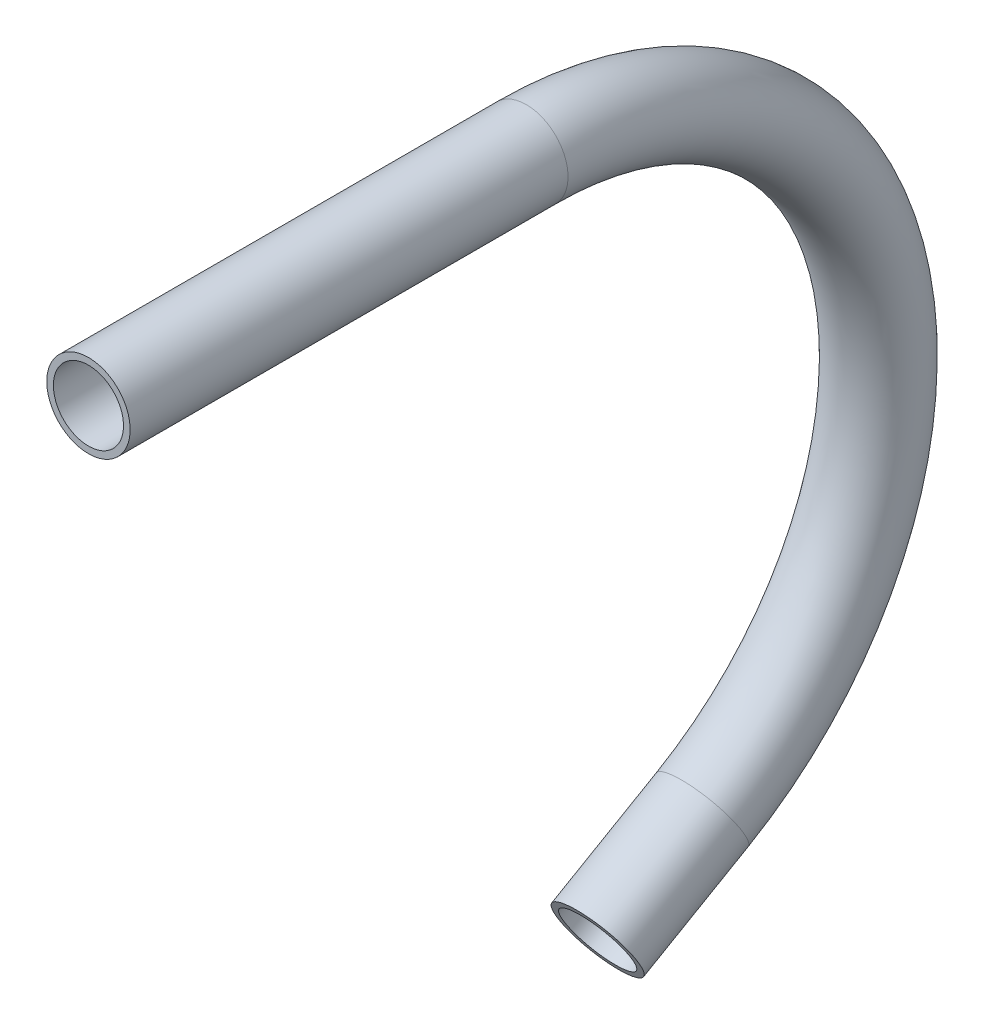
from build123d import *

# Parameters (mm, degrees)
SKETCH_2_R   = 17.25
SKETCH_2_R_2 = 14.5


with BuildPart() as part:
    # Sweep 1: sweep along a path in Sketch 1
    with BuildLine(Plane(origin=(0, 0, 0), x_dir=(0, 0, -1), z_dir=(1, 0, 0))) as sweep_1_path:
        Line((76, 165), (257.129024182, 165))
        ThreePointArc((257.129024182, 165), (397.774696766, 57.078779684), (329.932581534, -106.706575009))
        Line((329.932581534, -106.706575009), (286.631311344, -131.706575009))
    # Sketch 2 → Sweep 1 (sweep)
    with BuildSketch(Plane(origin=(0, 0, -76), x_dir=(-1, 0, 0), z_dir=(0, 0, -1))):
        with Locations((0, 165)):
            Circle(SKETCH_2_R)
        with Locations((0, 165)):
            Circle(SKETCH_2_R_2, mode=Mode.SUBTRACT)
    sweep(path=sweep_1_path.line)


solid = part.part
